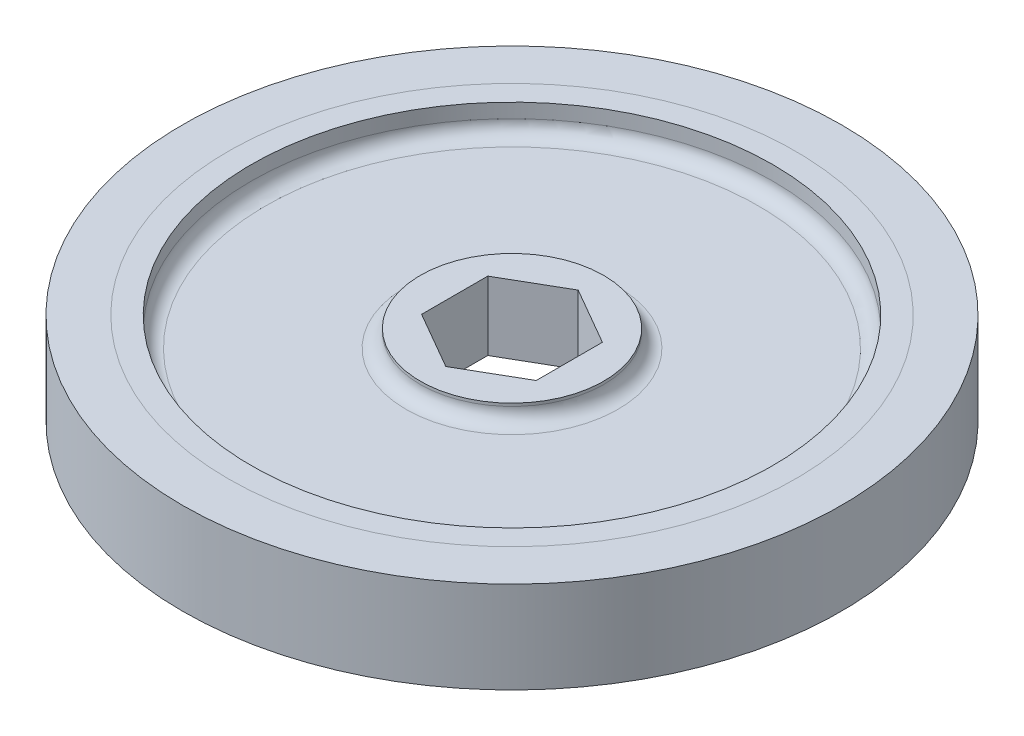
from build123d import *

# Parameters (mm, degrees)
CUT_EXTRUDE1_DEPTH = 53.396158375
FILLET1_R          = 1.5875


with BuildPart() as part:
    # Sketch1 → Revolve1 (revolve)
    with BuildSketch(Plane.XY, mode=Mode.PRIVATE) as revolve1_sk:
        Polygon((0, 0), (10.16, 0), (10.16, -1.905), (28.8925, -1.905), (28.8925, 1.27), (36.5125, 1.27), (36.5125, -8.89), (28.8925, -8.89), (28.8925, -5.715), (10.16, -5.715), (10.16, -7.62), (0, -7.62), align=None)
    revolve(revolve1_sk.sketch.rotate(Axis((0, -7.62, 0), (0, 1, 0)), 90), axis=Axis((0, -7.62, 0), (0, 1, 0)))

    # Sketch2 → Cut-Extrude1 (cut, through all)
    with BuildSketch(Plane(origin=(0, 0, 0), x_dir=(1, 0, 0), z_dir=(0, 1, 0))):
        Polygon((0, 7.332348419), (-6.35, 3.666174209), (-6.35, -3.666174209), (0, -7.332348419), (6.35, -3.666174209), (6.35, 3.666174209), align=None)
    extrude(amount=-CUT_EXTRUDE1_DEPTH, mode=Mode.SUBTRACT)

    # Fillet1
    fillet1_edges = [part.edges().sort_by_distance(p)[0] for p in [
        (0, -5.715, 28.8925),
        (0, -5.715, 10.16),
        (0, -1.905, 10.16),
        (0, -1.905, 28.8925),
    ]]
    fillet(fillet1_edges, radius=FILLET1_R)


solid = part.part
